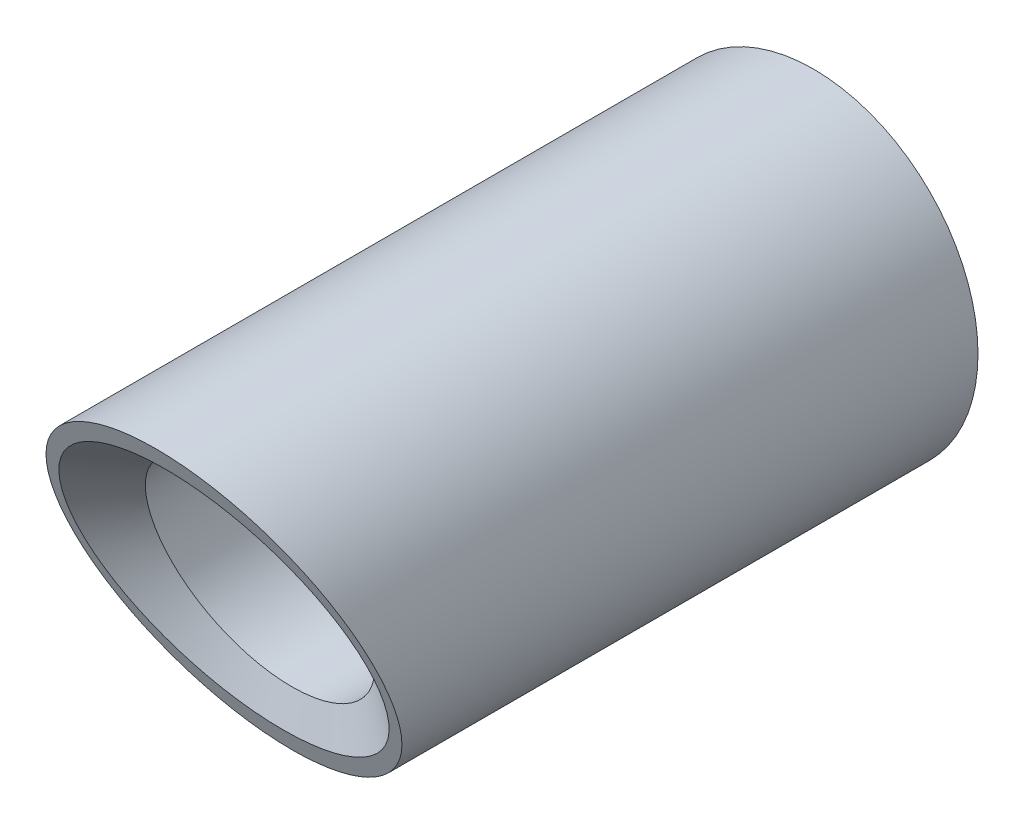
ISO-10303-21;
HEADER;
FILE_DESCRIPTION(('STEP AP214'),'2;1');
FILE_NAME('part.step','',(''),(''),'','','');
FILE_SCHEMA(('AUTOMOTIVE_DESIGN { 1 0 10303 214 1 1 1 1 }'));
ENDSEC;
DATA;
#1=APPLICATION_CONTEXT('core data for automotive mechanical design processes');
#2=APPLICATION_PROTOCOL_DEFINITION('international standard','automotive_design',2000,#1);
#3=PRODUCT_CONTEXT('',#1,'mechanical');
#4=PRODUCT('Part','Part','',(#3));
#5=PRODUCT_RELATED_PRODUCT_CATEGORY('part','',(#4));
#6=PRODUCT_DEFINITION_FORMATION('','',#4);
#7=PRODUCT_DEFINITION_CONTEXT('part definition',#1,'design');
#8=PRODUCT_DEFINITION('design','',#6,#7);
#9=PRODUCT_DEFINITION_SHAPE('','',#8);
#10=(LENGTH_UNIT() NAMED_UNIT(*) SI_UNIT(.MILLI.,.METRE.));
#11=(NAMED_UNIT(*) PLANE_ANGLE_UNIT() SI_UNIT($,.RADIAN.));
#12=(NAMED_UNIT(*) SI_UNIT($,.STERADIAN.) SOLID_ANGLE_UNIT());
#13=UNCERTAINTY_MEASURE_WITH_UNIT(LENGTH_MEASURE(1.E-05),#10,'distance_accuracy_value','');
#14=(GEOMETRIC_REPRESENTATION_CONTEXT(3) GLOBAL_UNCERTAINTY_ASSIGNED_CONTEXT((#13)) GLOBAL_UNIT_ASSIGNED_CONTEXT((#10,
#11,#12)) REPRESENTATION_CONTEXT('',''));
#15=CARTESIAN_POINT('',(0.,0.,0.));
#16=DIRECTION('',(0.,0.,1.));
#17=DIRECTION('',(1.,0.,0.));
#18=AXIS2_PLACEMENT_3D('',#15,#16,#17);
#19=CARTESIAN_POINT('',(0.,0.,30.));
#20=DIRECTION('',(0.,0.,-1.));
#21=DIRECTION('',(-1.,0.,0.));
#22=AXIS2_PLACEMENT_3D('',#19,#20,#21);
#23=CYLINDRICAL_SURFACE('',#22,5.);
#24=CARTESIAN_POINT('',(0.,0.,0.));
#25=DIRECTION('',(0.,0.,1.));
#26=DIRECTION('',(1.,0.,0.));
#27=AXIS2_PLACEMENT_3D('',#24,#25,#26);
#28=CIRCLE('',#27,5.);
#29=CARTESIAN_POINT('',(5.,0.,0.));
#30=VERTEX_POINT('',#29);
#31=EDGE_CURVE('E98',#30,#30,#28,.T.);
#32=ORIENTED_EDGE('',*,*,#31,.F.);
#33=EDGE_LOOP('',(#32));
#34=FACE_BOUND('',#33,.T.);
#35=CARTESIAN_POINT('',(2.08480551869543,4.54462165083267,26.7990863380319));
#36=CARTESIAN_POINT('',(2.00645513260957,4.58056886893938,26.8148567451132));
#37=CARTESIAN_POINT('',(1.92699832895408,4.61456180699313,26.8295871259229));
#38=CARTESIAN_POINT('',(1.7655727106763,4.67871099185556,26.857097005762));
#39=CARTESIAN_POINT('',(1.68359040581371,4.7088393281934,26.869862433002));
#40=CARTESIAN_POINT('',(1.51728591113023,4.76504009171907,26.8934426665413));
#41=CARTESIAN_POINT('',(1.43295093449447,4.791081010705,26.9042424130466));
#42=CARTESIAN_POINT('',(1.26213395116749,4.83889915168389,26.9238924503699));
#43=CARTESIAN_POINT('',(1.17564028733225,4.86064129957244,26.9327267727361));
#44=CARTESIAN_POINT('',(1.00071580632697,4.89965965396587,26.9484467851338));
#45=CARTESIAN_POINT('',(0.912274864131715,4.91689724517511,26.9553156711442));
#46=CARTESIAN_POINT('',(0.733683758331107,4.94671369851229,26.9671056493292));
#47=CARTESIAN_POINT('',(0.643525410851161,4.95925049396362,26.9720091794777));
#48=CARTESIAN_POINT('',(0.461745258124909,4.97948068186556,26.9798691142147));
#49=CARTESIAN_POINT('',(0.370117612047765,4.9871286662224,26.9828072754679));
#50=CARTESIAN_POINT('',(0.185661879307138,4.99741489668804,26.9867373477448));
#51=CARTESIAN_POINT('',(0.0928306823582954,5.00000462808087,26.987710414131));
#52=CARTESIAN_POINT('',(0.,5.,26.9877102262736));
#53=B_SPLINE_CURVE_WITH_KNOTS('',3,(#35,#36,#37,#38,#39,#40,#41,#42,#43,#44,#45,#46,#47,#48,#49,
#50,#51,#52),.UNSPECIFIED.,.F.,.F.,(4,2,2,2,2,2,2,2,4),(0.,0.2628675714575,0.527537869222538,
0.794157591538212,1.0628702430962,1.33381600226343,1.60713161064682,1.88295028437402,
2.16140164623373),.UNSPECIFIED.);
#54=CARTESIAN_POINT('',(2.08480551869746,4.54462165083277,26.7990863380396));
#55=VERTEX_POINT('',#54);
#56=CARTESIAN_POINT('',(0.,5.,26.9877102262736));
#57=VERTEX_POINT('',#56);
#58=EDGE_CURVE('E44',#55,#57,#53,.T.);
#59=ORIENTED_EDGE('',*,*,#58,.T.);
#60=CARTESIAN_POINT('',(0.,5.,26.9877102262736));
#61=CARTESIAN_POINT('',(-0.0928306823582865,5.00000462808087,26.987710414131));
#62=CARTESIAN_POINT('',(-0.18566187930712,4.99741489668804,26.9867373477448));
#63=CARTESIAN_POINT('',(-0.370117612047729,4.9871286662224,26.9828072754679));
#64=CARTESIAN_POINT('',(-0.461745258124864,4.97948068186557,26.9798691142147));
#65=CARTESIAN_POINT('',(-0.643525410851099,4.95925049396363,26.9720091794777));
#66=CARTESIAN_POINT('',(-0.733683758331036,4.9467136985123,26.9671056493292));
#67=CARTESIAN_POINT('',(-0.912274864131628,4.91689724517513,26.9553156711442));
#68=CARTESIAN_POINT('',(-1.00071580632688,4.89965965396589,26.9484467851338));
#69=CARTESIAN_POINT('',(-1.17564028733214,4.86064129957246,26.9327267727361));
#70=CARTESIAN_POINT('',(-1.26213395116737,4.83889915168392,26.9238924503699));
#71=CARTESIAN_POINT('',(-1.43295093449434,4.79108101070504,26.9042424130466));
#72=CARTESIAN_POINT('',(-1.51728591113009,4.76504009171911,26.8934426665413));
#73=CARTESIAN_POINT('',(-1.68359040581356,4.70883932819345,26.869862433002));
#74=CARTESIAN_POINT('',(-1.76557271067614,4.67871099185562,26.857097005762));
#75=CARTESIAN_POINT('',(-1.92699832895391,4.6145618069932,26.829587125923));
#76=CARTESIAN_POINT('',(-2.0064551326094,4.58056886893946,26.8148567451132));
#77=CARTESIAN_POINT('',(-2.08480551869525,4.54462165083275,26.799086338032));
#78=B_SPLINE_CURVE_WITH_KNOTS('',3,(#60,#61,#62,#63,#64,#65,#66,#67,#68,#69,#70,#71,#72,#73,#74,
#75,#76,#77),.UNSPECIFIED.,.F.,.F.,(4,2,2,2,2,2,2,2,4),(0.,0.278451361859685,0.554270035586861,
0.827585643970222,1.09853140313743,1.36724405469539,1.63386377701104,1.89853407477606,
2.16140164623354),.UNSPECIFIED.);
#79=CARTESIAN_POINT('',(-2.08480551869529,4.54462165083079,26.7990863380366));
#80=VERTEX_POINT('',#79);
#81=EDGE_CURVE('E11',#57,#80,#78,.T.);
#82=ORIENTED_EDGE('',*,*,#81,.T.);
#83=CARTESIAN_POINT('',(-3.25168097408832,-3.79823259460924,24.1322412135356));
#84=CARTESIAN_POINT('',(-3.05378134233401,-3.96764188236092,24.0848744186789));
#85=CARTESIAN_POINT('',(-2.84192690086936,-4.12214670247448,24.0418581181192));
#86=CARTESIAN_POINT('',(-2.39523433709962,-4.3967817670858,23.9655885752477));
#87=CARTESIAN_POINT('',(-2.16038054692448,-4.51688835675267,23.9323420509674));
#88=CARTESIAN_POINT('',(-1.66018002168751,-4.72451410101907,23.8749618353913));
#89=CARTESIAN_POINT('',(-1.39386750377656,-4.80988634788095,23.8514274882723));
#90=CARTESIAN_POINT('',(-0.849974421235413,-4.93512126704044,23.8169300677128));
#91=CARTESIAN_POINT('',(-0.572394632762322,-4.97498706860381,23.8059661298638));
#92=CARTESIAN_POINT('',(-0.020970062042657,-5.00739555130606,23.7970520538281));
#93=CARTESIAN_POINT('',(0.252804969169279,-5.00104867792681,23.798796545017));
#94=CARTESIAN_POINT('',(0.795287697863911,-4.9438747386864,23.8145262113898));
#95=CARTESIAN_POINT('',(1.06399579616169,-4.89305120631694,23.8285104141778));
#96=CARTESIAN_POINT('',(1.58742766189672,-4.74904168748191,23.8682053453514));
#97=CARTESIAN_POINT('',(1.84221426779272,-4.6560673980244,23.8938574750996));
#98=CARTESIAN_POINT('',(2.33235293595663,-4.43090066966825,23.9561465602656));
#99=CARTESIAN_POINT('',(2.56770380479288,-4.29870582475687,23.9927841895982));
#100=CARTESIAN_POINT('',(3.01664838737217,-3.99677671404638,24.076765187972));
#101=CARTESIAN_POINT('',(3.22981410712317,-3.82645351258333,24.1242768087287));
#102=CARTESIAN_POINT('',(3.62456970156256,-3.45485286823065,24.2284313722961));
#103=CARTESIAN_POINT('',(3.80615524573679,-3.25357118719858,24.2850755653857));
#104=CARTESIAN_POINT('',(4.13885394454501,-2.81906436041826,24.4080964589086));
#105=CARTESIAN_POINT('',(4.28880876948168,-2.58502437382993,24.4747261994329));
#106=CARTESIAN_POINT('',(4.54740302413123,-2.09700095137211,24.6147582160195));
#107=CARTESIAN_POINT('',(4.65603524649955,-1.84301404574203,24.6881616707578));
#108=CARTESIAN_POINT('',(4.83302320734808,-1.31259555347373,24.8429483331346));
#109=CARTESIAN_POINT('',(4.89976530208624,-1.03568320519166,24.9245249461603));
#110=CARTESIAN_POINT('',(4.98538360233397,-0.475551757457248,25.0915911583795));
#111=CARTESIAN_POINT('',(5.00425198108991,-0.192331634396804,25.177081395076));
#112=CARTESIAN_POINT('',(4.99658486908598,0.235296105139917,25.3081002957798));
#113=CARTESIAN_POINT('',(4.98762332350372,0.380450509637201,25.3529145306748));
#114=CARTESIAN_POINT('',(4.95712298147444,0.669321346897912,25.4428502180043));
#115=CARTESIAN_POINT('',(4.93558843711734,0.813038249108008,25.4879715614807));
#116=CARTESIAN_POINT('',(4.88009170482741,1.09809318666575,25.5782891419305));
#117=CARTESIAN_POINT('',(4.84612377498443,1.23943009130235,25.6234854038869));
#118=CARTESIAN_POINT('',(4.76601087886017,1.51862491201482,25.7136517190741));
#119=CARTESIAN_POINT('',(4.71987037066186,1.65648408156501,25.7586218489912));
#120=CARTESIAN_POINT('',(4.61500028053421,1.92962714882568,25.8486690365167));
#121=CARTESIAN_POINT('',(4.55610981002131,2.06485151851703,25.8937394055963));
#122=CARTESIAN_POINT('',(4.42651588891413,2.32974010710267,25.9830346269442));
#123=CARTESIAN_POINT('',(4.35581689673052,2.45940640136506,26.0272597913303));
#124=CARTESIAN_POINT('',(4.20299043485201,2.71232610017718,26.1145518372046));
#125=CARTESIAN_POINT('',(4.12085752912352,2.83557641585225,26.1576181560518));
#126=CARTESIAN_POINT('',(3.94572779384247,3.07460135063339,26.242164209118));
#127=CARTESIAN_POINT('',(3.85273548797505,3.1903790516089,26.283644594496));
#128=CARTESIAN_POINT('',(3.65757481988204,3.4122902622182,26.3641353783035));
#129=CARTESIAN_POINT('',(3.55552583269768,3.51852032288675,26.4031689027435));
#130=CARTESIAN_POINT('',(3.3420174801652,3.7219144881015,26.4788091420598));
#131=CARTESIAN_POINT('',(3.23056224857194,3.81908253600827,26.515416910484));
#132=CARTESIAN_POINT('',(2.99887555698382,4.00358354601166,26.5857362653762));
#133=CARTESIAN_POINT('',(2.87864160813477,4.0909137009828,26.6194470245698));
#134=CARTESIAN_POINT('',(2.6302826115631,4.25484893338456,26.6834153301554));
#135=CARTESIAN_POINT('',(2.50216141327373,4.33145918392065,26.7136745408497));
#136=CARTESIAN_POINT('',(2.24499016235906,4.46993841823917,26.7689016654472));
#137=CARTESIAN_POINT('',(2.11625791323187,4.53232578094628,26.794049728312));
#138=CARTESIAN_POINT('',(1.85335000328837,4.64602989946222,26.8402481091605));
#139=CARTESIAN_POINT('',(1.71917692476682,4.69735183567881,26.8613003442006));
#140=CARTESIAN_POINT('',(1.44637309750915,4.78838973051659,26.898881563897));
#141=CARTESIAN_POINT('',(1.30774364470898,4.82810902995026,26.9154118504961));
#142=CARTESIAN_POINT('',(1.02710026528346,4.89549646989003,26.9435841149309));
#143=CARTESIAN_POINT('',(0.885086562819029,4.92316540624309,26.9552264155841));
#144=CARTESIAN_POINT('',(0.609062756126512,4.96458576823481,26.9726995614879));
#145=CARTESIAN_POINT('',(0.475202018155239,4.97918727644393,26.9788849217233));
#146=CARTESIAN_POINT('',(0.206556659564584,4.99754591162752,26.9866667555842));
#147=CARTESIAN_POINT('',(0.071771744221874,5.00129940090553,26.9882616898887));
#148=CARTESIAN_POINT('',(-0.197557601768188,4.99790946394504,26.9868229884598));
#149=CARTESIAN_POINT('',(-0.332102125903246,4.99077227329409,26.9837920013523));
#150=CARTESIAN_POINT('',(-0.600047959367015,4.96568775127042,26.9731710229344));
#151=CARTESIAN_POINT('',(-0.733448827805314,4.94773642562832,26.9655793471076));
#152=CARTESIAN_POINT('',(-0.993128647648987,4.90208362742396,26.94636341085));
#153=CARTESIAN_POINT('',(-1.11948792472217,4.8747697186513,26.9348996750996));
#154=CARTESIAN_POINT('',(-1.36937233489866,4.8105580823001,26.9081100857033));
#155=CARTESIAN_POINT('',(-1.49289645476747,4.7736569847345,26.892782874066));
#156=CARTESIAN_POINT('',(-1.73625628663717,4.69062178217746,26.8585439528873));
#157=CARTESIAN_POINT('',(-1.85609297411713,4.64449014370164,26.8396332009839));
#158=CARTESIAN_POINT('',(-2.09141479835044,4.54339222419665,26.7985363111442));
#159=CARTESIAN_POINT('',(-2.20689826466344,4.48842259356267,26.7763489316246));
#160=CARTESIAN_POINT('',(-2.55358537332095,4.30681589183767,26.7037336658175));
#161=CARTESIAN_POINT('',(-2.77671553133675,4.16631651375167,26.6484435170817));
#162=CARTESIAN_POINT('',(-3.19649282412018,3.85370730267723,26.5282565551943));
#163=CARTESIAN_POINT('',(-3.39313259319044,3.68158870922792,26.4633570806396));
#164=CARTESIAN_POINT('',(-3.76858028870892,3.29767899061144,26.3220042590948));
#165=CARTESIAN_POINT('',(-3.94525930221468,3.0839834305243,26.2450649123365));
#166=CARTESIAN_POINT('',(-4.26037383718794,2.6315729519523,26.0861080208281));
#167=CARTESIAN_POINT('',(-4.39879935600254,2.39285151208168,26.0040891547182));
#168=CARTESIAN_POINT('',(-4.57848389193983,2.01454778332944,25.8769384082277));
#169=CARTESIAN_POINT('',(-4.63471293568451,1.88155621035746,25.8327329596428));
#170=CARTESIAN_POINT('',(-4.73542808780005,1.61135907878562,25.7438698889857));
#171=CARTESIAN_POINT('',(-4.77991791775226,1.4741548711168,25.6992124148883));
#172=CARTESIAN_POINT('',(-4.85688860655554,1.19641810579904,25.6097015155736));
#173=CARTESIAN_POINT('',(-4.88936405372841,1.05588407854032,25.5648480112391));
#174=CARTESIAN_POINT('',(-4.94205431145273,0.772561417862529,25.4752373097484));
#175=CARTESIAN_POINT('',(-4.96227352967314,0.629773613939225,25.4304800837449));
#176=CARTESIAN_POINT('',(-4.99059987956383,0.339927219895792,25.3403750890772));
#177=CARTESIAN_POINT('',(-4.99844904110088,0.192841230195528,25.2950341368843));
#178=CARTESIAN_POINT('',(-5.00113451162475,-0.101579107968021,25.2049658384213));
#179=CARTESIAN_POINT('',(-4.99597555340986,-0.248913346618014,25.160238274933));
#180=CARTESIAN_POINT('',(-4.97262713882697,-0.54289494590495,25.0716020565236));
#181=CARTESIAN_POINT('',(-4.95442968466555,-0.689541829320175,25.0276939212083));
#182=CARTESIAN_POINT('',(-4.90506332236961,-0.980906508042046,24.9409895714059));
#183=CARTESIAN_POINT('',(-4.87389956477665,-1.1256250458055,24.8981929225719));
#184=CARTESIAN_POINT('',(-4.79896065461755,-1.41125806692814,24.8141852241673));
#185=CARTESIAN_POINT('',(-4.75526002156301,-1.55218979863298,24.7729663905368));
#186=CARTESIAN_POINT('',(-4.65542181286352,-1.8299792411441,24.6921111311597));
#187=CARTESIAN_POINT('',(-4.59928917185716,-1.96683854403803,24.6524740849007));
#188=CARTESIAN_POINT('',(-4.47493308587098,-2.23536212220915,24.5750348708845));
#189=CARTESIAN_POINT('',(-4.40671900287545,-2.36703032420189,24.5372313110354));
#190=CARTESIAN_POINT('',(-4.25861266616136,-2.62416462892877,24.4636801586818));
#191=CARTESIAN_POINT('',(-4.17872326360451,-2.74963223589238,24.4279320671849));
#192=CARTESIAN_POINT('',(-3.97368539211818,-3.041888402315,24.3449338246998));
#193=CARTESIAN_POINT('',(-3.84317250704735,-3.205267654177,24.2987628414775));
#194=CARTESIAN_POINT('',(-3.56202719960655,-3.51507588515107,24.2115310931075));
#195=CARTESIAN_POINT('',(-3.41139884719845,-3.66150828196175,24.1704692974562));
#196=CARTESIAN_POINT('',(-3.25168097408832,-3.79823259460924,24.1322412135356));
#197=B_SPLINE_CURVE_WITH_KNOTS('',3,(#83,#84,#85,#86,#87,#88,#89,#90,#91,#92,#93,#94,#95,#96,
#97,#98,#99,#100,#101,#102,#103,#104,#105,#106,#107,#108,#109,#110,#111,#112,#113,#114,#115,
#116,#117,#118,#119,#120,#121,#122,#123,#124,#125,#126,#127,#128,#129,#130,#131,#132,#133,#134,
#135,#136,#137,#138,#139,#140,#141,#142,#143,#144,#145,#146,#147,#148,#149,#150,#151,#152,#153,
#154,#155,#156,#157,#158,#159,#160,#161,#162,#163,#164,#165,#166,#167,#168,#169,#170,#171,#172,
#173,#174,#175,#176,#177,#178,#179,#180,#181,#182,#183,#184,#185,#186,#187,#188,#189,#190,#191,
#192,#193,#194,#195,#196),.UNSPECIFIED.,.T.,.F.,(4,2,2,2,2,2,2,2,2,2,2,2,2,2,2,2,2,2,2,2,2,2,2,
2,2,2,2,2,2,2,2,2,2,2,2,2,2,2,2,2,2,2,2,2,2,2,2,2,2,2,2,2,2,2,2,2,4),(0.,0.793677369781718,
1.58789922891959,2.42565193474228,3.26334702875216,4.08098072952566,4.89854947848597,
5.71205681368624,6.52561406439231,7.35273058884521,8.17996044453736,9.03360798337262,
9.88740434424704,10.772343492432,11.6574273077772,12.1135268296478,12.5694721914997,
13.0256283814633,13.4816177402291,13.943736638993,14.4056814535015,14.8678466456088,
15.3298199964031,15.7864173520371,16.2428150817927,16.6993427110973,17.1556492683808,
17.5908236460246,18.0257938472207,18.4606386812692,18.8954547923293,19.2993371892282,
19.7033550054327,20.1071415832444,20.5110773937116,20.899986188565,21.2890318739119,
21.6779737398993,22.0670633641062,22.8715206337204,23.6762011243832,24.535727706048,
25.3954788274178,25.8480618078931,26.3005011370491,26.7531440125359,27.2056240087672,
27.6674209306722,28.1290498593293,28.5909621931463,29.052691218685,29.5117306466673,
29.970588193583,30.4290917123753,30.8874834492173,31.5281621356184,32.1687113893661),.UNSPECIFIED.);
#198=EDGE_CURVE('E54',#80,#55,#197,.T.);
#199=ORIENTED_EDGE('',*,*,#198,.T.);
#200=EDGE_LOOP('',(#59,#82,#199));
#201=FACE_BOUND('',#200,.T.);
#202=ADVANCED_FACE('F33',(#34,#201),#23,.F.);
#203=CARTESIAN_POINT('',(55.3029326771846,7.5,30.));
#204=DIRECTION('',(0.,0.38268343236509,-0.923879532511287));
#205=DIRECTION('',(0.,0.923879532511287,0.38268343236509));
#206=AXIS2_PLACEMENT_3D('',#203,#204,#205);
#207=PLANE('',#206);
#208=CARTESIAN_POINT('',(0.,0.,26.8933982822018));
#209=DIRECTION('',(0.,0.38268343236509,-0.923879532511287));
#210=DIRECTION('',(0.,-0.923879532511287,-0.38268343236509));
#211=AXIS2_PLACEMENT_3D('',#208,#209,#210);
#212=ELLIPSE('',#211,8.11794150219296,7.5);
#213=CARTESIAN_POINT('',(0.,-7.5,23.7867965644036));
#214=VERTEX_POINT('',#213);
#215=EDGE_CURVE('E99',#214,#214,#212,.T.);
#216=ORIENTED_EDGE('',*,*,#215,.F.);
#217=EDGE_LOOP('',(#216));
#218=FACE_BOUND('',#217,.T.);
#219=CARTESIAN_POINT('',(0.,0.,26.8933982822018));
#220=DIRECTION('',(0.,-0.38268343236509,0.923879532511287));
#221=DIRECTION('',(0.,-0.923879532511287,-0.38268343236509));
#222=AXIS2_PLACEMENT_3D('',#219,#220,#221);
#223=CIRCLE('',#222,7.03554930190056);
#224=CARTESIAN_POINT('',(0.,-6.5,24.2010101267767));
#225=VERTEX_POINT('',#224);
#226=EDGE_CURVE('E124',#225,#225,#223,.T.);
#227=ORIENTED_EDGE('',*,*,#226,.F.);
#228=EDGE_LOOP('',(#227));
#229=FACE_BOUND('',#228,.T.);
#230=ADVANCED_FACE('F80',(#218,#229),#207,.F.);
#231=CARTESIAN_POINT('',(0.,0.,0.));
#232=DIRECTION('',(0.,0.,1.));
#233=DIRECTION('',(1.,0.,0.));
#234=AXIS2_PLACEMENT_3D('',#231,#232,#233);
#235=PLANE('',#234);
#236=CARTESIAN_POINT('',(0.,0.,0.));
#237=DIRECTION('',(0.,0.,1.));
#238=DIRECTION('',(1.,0.,0.));
#239=AXIS2_PLACEMENT_3D('',#236,#237,#238);
#240=CIRCLE('',#239,7.5);
#241=CARTESIAN_POINT('',(7.5,0.,0.));
#242=VERTEX_POINT('',#241);
#243=EDGE_CURVE('E62',#242,#242,#240,.T.);
#244=ORIENTED_EDGE('',*,*,#243,.F.);
#245=EDGE_LOOP('',(#244));
#246=FACE_BOUND('',#245,.T.);
#247=ORIENTED_EDGE('',*,*,#31,.T.);
#248=EDGE_LOOP('',(#247));
#249=FACE_BOUND('',#248,.T.);
#250=ADVANCED_FACE('F82',(#246,#249),#235,.F.);
#251=CARTESIAN_POINT('',(0.,0.,30.));
#252=DIRECTION('',(0.,0.,-1.));
#253=DIRECTION('',(-1.,0.,0.));
#254=AXIS2_PLACEMENT_3D('',#251,#252,#253);
#255=CYLINDRICAL_SURFACE('',#254,7.5);
#256=ORIENTED_EDGE('',*,*,#215,.T.);
#257=EDGE_LOOP('',(#256));
#258=FACE_BOUND('',#257,.T.);
#259=ORIENTED_EDGE('',*,*,#243,.T.);
#260=EDGE_LOOP('',(#259));
#261=FACE_BOUND('',#260,.T.);
#262=ADVANCED_FACE('F35',(#258,#261),#255,.T.);
#263=CARTESIAN_POINT('',(0.,0.698888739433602,25.2061316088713));
#264=DIRECTION('',(0.,-0.38268343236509,0.923879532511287));
#265=DIRECTION('',(0.,-0.923879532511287,-0.38268343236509));
#266=AXIS2_PLACEMENT_3D('',#263,#264,#265);
#267=CONICAL_SURFACE('',#266,4.65548928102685,0.916297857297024);
#268=ORIENTED_EDGE('',*,*,#226,.T.);
#269=EDGE_LOOP('',(#268));
#270=FACE_BOUND('',#269,.T.);
#271=ORIENTED_EDGE('',*,*,#81,.F.);
#272=ORIENTED_EDGE('',*,*,#58,.F.);
#273=ORIENTED_EDGE('',*,*,#198,.F.);
#274=EDGE_LOOP('',(#271,#272,#273));
#275=FACE_BOUND('',#274,.T.);
#276=ADVANCED_FACE('F57',(#270,#275),#267,.F.);
#277=CLOSED_SHELL('',(#202,#230,#250,#262,#276));
#278=MANIFOLD_SOLID_BREP('B2',#277);
#279=ADVANCED_BREP_SHAPE_REPRESENTATION('',(#18,#278),#14);
#280=SHAPE_DEFINITION_REPRESENTATION(#9,#279);
ENDSEC;
END-ISO-10303-21;
